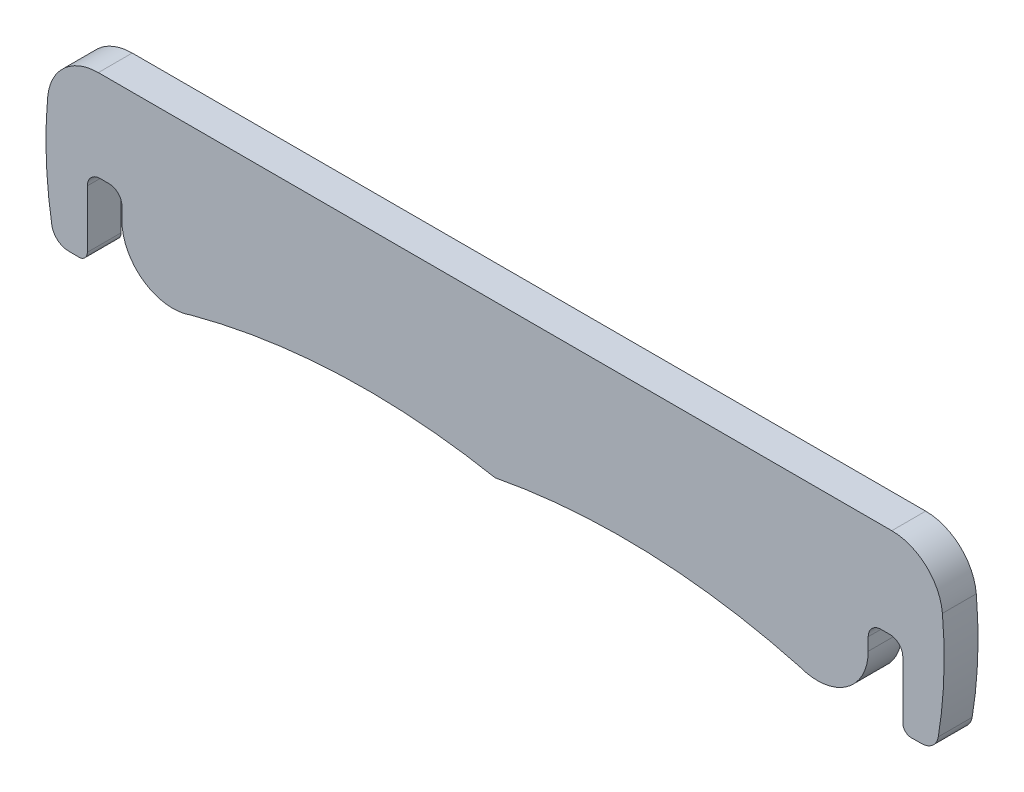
ISO-10303-21;
HEADER;
FILE_DESCRIPTION(('STEP AP214'),'2;1');
FILE_NAME('part.step','',(''),(''),'','','');
FILE_SCHEMA(('AUTOMOTIVE_DESIGN { 1 0 10303 214 1 1 1 1 }'));
ENDSEC;
DATA;
#1=APPLICATION_CONTEXT('core data for automotive mechanical design processes');
#2=APPLICATION_PROTOCOL_DEFINITION('international standard','automotive_design',2000,#1);
#3=PRODUCT_CONTEXT('',#1,'mechanical');
#4=PRODUCT('Part','Part','',(#3));
#5=PRODUCT_RELATED_PRODUCT_CATEGORY('part','',(#4));
#6=PRODUCT_DEFINITION_FORMATION('','',#4);
#7=PRODUCT_DEFINITION_CONTEXT('part definition',#1,'design');
#8=PRODUCT_DEFINITION('design','',#6,#7);
#9=PRODUCT_DEFINITION_SHAPE('','',#8);
#10=(LENGTH_UNIT() NAMED_UNIT(*) SI_UNIT(.MILLI.,.METRE.));
#11=(NAMED_UNIT(*) PLANE_ANGLE_UNIT() SI_UNIT($,.RADIAN.));
#12=(NAMED_UNIT(*) SI_UNIT($,.STERADIAN.) SOLID_ANGLE_UNIT());
#13=UNCERTAINTY_MEASURE_WITH_UNIT(LENGTH_MEASURE(1.E-05),#10,'distance_accuracy_value','');
#14=(GEOMETRIC_REPRESENTATION_CONTEXT(3) GLOBAL_UNCERTAINTY_ASSIGNED_CONTEXT((#13)) GLOBAL_UNIT_ASSIGNED_CONTEXT((#10,
#11,#12)) REPRESENTATION_CONTEXT('',''));
#15=CARTESIAN_POINT('',(0.,0.,0.));
#16=DIRECTION('',(0.,0.,1.));
#17=DIRECTION('',(1.,0.,0.));
#18=AXIS2_PLACEMENT_3D('',#15,#16,#17);
#19=CARTESIAN_POINT('',(-134.420915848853,-25.6748577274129,12.7));
#20=DIRECTION('',(0.,0.,1.));
#21=DIRECTION('',(1.,0.,0.));
#22=AXIS2_PLACEMENT_3D('',#19,#20,#21);
#23=CYLINDRICAL_SURFACE('',#22,6.3499999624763);
#24=DIRECTION('',(0.,0.,1.));
#25=VECTOR('',#24,1.);
#26=CARTESIAN_POINT('',(-140.683934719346,-26.7222803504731,12.7));
#27=LINE('',#26,#25);
#28=CARTESIAN_POINT('',(-140.683934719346,-26.7222803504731,12.7));
#29=VERTEX_POINT('',#28);
#30=CARTESIAN_POINT('',(-140.683934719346,-26.7222803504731,25.4));
#31=VERTEX_POINT('',#30);
#32=EDGE_CURVE('E12',#29,#31,#27,.T.);
#33=ORIENTED_EDGE('',*,*,#32,.F.);
#34=CARTESIAN_POINT('',(-134.420915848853,-25.6748577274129,12.7));
#35=DIRECTION('',(0.,0.,1.));
#36=DIRECTION('',(1.,0.,0.));
#37=AXIS2_PLACEMENT_3D('',#34,#35,#36);
#38=CIRCLE('',#37,6.3499999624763);
#39=CARTESIAN_POINT('',(-134.501831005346,-32.0243421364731,12.7));
#40=VERTEX_POINT('',#39);
#41=EDGE_CURVE('E314',#29,#40,#38,.T.);
#42=ORIENTED_EDGE('',*,*,#41,.T.);
#43=DIRECTION('',(0.,0.,1.));
#44=VECTOR('',#43,1.);
#45=CARTESIAN_POINT('',(-134.501831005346,-32.0243421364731,12.7));
#46=LINE('',#45,#44);
#47=CARTESIAN_POINT('',(-134.501831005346,-32.0243421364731,25.4));
#48=VERTEX_POINT('',#47);
#49=EDGE_CURVE('E31',#40,#48,#46,.T.);
#50=ORIENTED_EDGE('',*,*,#49,.T.);
#51=CARTESIAN_POINT('',(-134.420915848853,-25.6748577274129,25.4));
#52=DIRECTION('',(0.,0.,1.));
#53=DIRECTION('',(1.,0.,0.));
#54=AXIS2_PLACEMENT_3D('',#51,#52,#53);
#55=CIRCLE('',#54,6.3499999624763);
#56=EDGE_CURVE('E323',#31,#48,#55,.T.);
#57=ORIENTED_EDGE('',*,*,#56,.F.);
#58=EDGE_LOOP('',(#33,#42,#50,#57));
#59=FACE_BOUND('',#58,.T.);
#60=ADVANCED_FACE('F20',(#59),#23,.T.);
#61=CARTESIAN_POINT('',(-130.601670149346,-32.0740319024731,12.7));
#62=DIRECTION('',(-0.0127394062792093,-0.999918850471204,0.));
#63=DIRECTION('',(0.999918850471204,-0.0127394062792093,0.));
#64=AXIS2_PLACEMENT_3D('',#61,#62,#63);
#65=PLANE('',#64);
#66=ORIENTED_EDGE('',*,*,#49,.F.);
#67=DIRECTION('',(0.999918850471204,-0.0127394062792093,0.));
#68=VECTOR('',#67,1.);
#69=CARTESIAN_POINT('',(-130.601670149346,-32.0740319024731,12.7));
#70=LINE('',#69,#68);
#71=CARTESIAN_POINT('',(-130.601670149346,-32.0740319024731,12.7));
#72=VERTEX_POINT('',#71);
#73=EDGE_CURVE('E308',#40,#72,#70,.T.);
#74=ORIENTED_EDGE('',*,*,#73,.T.);
#75=DIRECTION('',(0.,0.,1.));
#76=VECTOR('',#75,1.);
#77=CARTESIAN_POINT('',(-130.601670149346,-32.0740319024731,12.7));
#78=LINE('',#77,#76);
#79=CARTESIAN_POINT('',(-130.601670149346,-32.0740319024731,25.4));
#80=VERTEX_POINT('',#79);
#81=EDGE_CURVE('E510',#72,#80,#78,.T.);
#82=ORIENTED_EDGE('',*,*,#81,.T.);
#83=DIRECTION('',(0.999918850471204,-0.0127394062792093,0.));
#84=VECTOR('',#83,1.);
#85=CARTESIAN_POINT('',(-130.601670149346,-32.0740319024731,25.4));
#86=LINE('',#85,#84);
#87=EDGE_CURVE('E331',#48,#80,#86,.T.);
#88=ORIENTED_EDGE('',*,*,#87,.F.);
#89=EDGE_LOOP('',(#66,#74,#82,#88));
#90=FACE_BOUND('',#89,.T.);
#91=ADVANCED_FACE('F525',(#90),#65,.T.);
#92=CARTESIAN_POINT('',(-130.561209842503,-28.8992878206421,12.7));
#93=DIRECTION('',(0.,0.,1.));
#94=DIRECTION('',(1.,0.,0.));
#95=AXIS2_PLACEMENT_3D('',#92,#93,#94);
#96=CYLINDRICAL_SURFACE('',#95,3.17500189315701);
#97=ORIENTED_EDGE('',*,*,#81,.F.);
#98=CARTESIAN_POINT('',(-130.561209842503,-28.8992878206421,12.7));
#99=DIRECTION('',(0.,0.,1.));
#100=DIRECTION('',(1.,0.,0.));
#101=AXIS2_PLACEMENT_3D('',#98,#99,#100);
#102=CIRCLE('',#101,3.17500189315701);
#103=CARTESIAN_POINT('',(-127.386207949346,-28.899285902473,12.7));
#104=VERTEX_POINT('',#103);
#105=EDGE_CURVE('E304',#72,#104,#102,.T.);
#106=ORIENTED_EDGE('',*,*,#105,.T.);
#107=DIRECTION('',(0.,0.,1.));
#108=VECTOR('',#107,1.);
#109=CARTESIAN_POINT('',(-127.386207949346,-28.899285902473,12.7));
#110=LINE('',#109,#108);
#111=CARTESIAN_POINT('',(-127.386207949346,-28.899285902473,25.4));
#112=VERTEX_POINT('',#111);
#113=EDGE_CURVE('E502',#104,#112,#110,.T.);
#114=ORIENTED_EDGE('',*,*,#113,.T.);
#115=CARTESIAN_POINT('',(-130.561209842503,-28.8992878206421,25.4));
#116=DIRECTION('',(0.,0.,1.));
#117=DIRECTION('',(1.,0.,0.));
#118=AXIS2_PLACEMENT_3D('',#115,#116,#117);
#119=CIRCLE('',#118,3.17500189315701);
#120=EDGE_CURVE('E334',#80,#112,#119,.T.);
#121=ORIENTED_EDGE('',*,*,#120,.F.);
#122=EDGE_LOOP('',(#97,#106,#114,#121));
#123=FACE_BOUND('',#122,.T.);
#124=ADVANCED_FACE('F528',(#123),#96,.T.);
#125=CARTESIAN_POINT('',(-127.386207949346,-7.336057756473,12.7));
#126=DIRECTION('',(1.,0.,0.));
#127=DIRECTION('',(0.,1.,0.));
#128=AXIS2_PLACEMENT_3D('',#125,#126,#127);
#129=PLANE('',#128);
#130=ORIENTED_EDGE('',*,*,#113,.F.);
#131=DIRECTION('',(0.,1.,0.));
#132=VECTOR('',#131,1.);
#133=CARTESIAN_POINT('',(-127.386207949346,-7.336057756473,12.7));
#134=LINE('',#133,#132);
#135=CARTESIAN_POINT('',(-127.386207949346,-7.336057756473,12.7));
#136=VERTEX_POINT('',#135);
#137=EDGE_CURVE('E300',#104,#136,#134,.T.);
#138=ORIENTED_EDGE('',*,*,#137,.T.);
#139=DIRECTION('',(0.,0.,1.));
#140=VECTOR('',#139,1.);
#141=CARTESIAN_POINT('',(-127.386207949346,-7.336057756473,12.7));
#142=LINE('',#141,#140);
#143=CARTESIAN_POINT('',(-127.386207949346,-7.336057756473,25.4));
#144=VERTEX_POINT('',#143);
#145=EDGE_CURVE('E499',#136,#144,#142,.T.);
#146=ORIENTED_EDGE('',*,*,#145,.T.);
#147=DIRECTION('',(0.,1.,0.));
#148=VECTOR('',#147,1.);
#149=CARTESIAN_POINT('',(-127.386207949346,12.4251426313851,25.4));
#150=LINE('',#149,#148);
#151=EDGE_CURVE('E338',#112,#144,#150,.T.);
#152=ORIENTED_EDGE('',*,*,#151,.F.);
#153=EDGE_LOOP('',(#130,#138,#146,#152));
#154=FACE_BOUND('',#153,.T.);
#155=ADVANCED_FACE('F533',(#154),#129,.T.);
#156=CARTESIAN_POINT('',(-122.611007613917,-7.33605756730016,12.7));
#157=DIRECTION('',(0.,0.,-1.));
#158=DIRECTION('',(-1.,0.,0.));
#159=AXIS2_PLACEMENT_3D('',#156,#157,#158);
#160=CYLINDRICAL_SURFACE('',#159,4.77520033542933);
#161=ORIENTED_EDGE('',*,*,#145,.F.);
#162=CARTESIAN_POINT('',(-122.611007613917,-7.33605756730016,12.7));
#163=DIRECTION('',(0.,0.,-1.));
#164=DIRECTION('',(1.,0.,0.));
#165=AXIS2_PLACEMENT_3D('',#162,#163,#164);
#166=CIRCLE('',#165,4.77520033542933);
#167=CARTESIAN_POINT('',(-122.611007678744,-2.56085723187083,12.7));
#168=VERTEX_POINT('',#167);
#169=EDGE_CURVE('E297',#136,#168,#166,.T.);
#170=ORIENTED_EDGE('',*,*,#169,.T.);
#171=DIRECTION('',(0.,0.,1.));
#172=VECTOR('',#171,1.);
#173=CARTESIAN_POINT('',(-122.611007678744,-2.56085723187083,12.7));
#174=LINE('',#173,#172);
#175=CARTESIAN_POINT('',(-122.611007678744,-2.56085723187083,25.4));
#176=VERTEX_POINT('',#175);
#177=EDGE_CURVE('E496',#168,#176,#174,.T.);
#178=ORIENTED_EDGE('',*,*,#177,.T.);
#179=CARTESIAN_POINT('',(-122.611007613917,-7.33605756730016,25.4));
#180=DIRECTION('',(0.,0.,-1.));
#181=DIRECTION('',(-1.,0.,0.));
#182=AXIS2_PLACEMENT_3D('',#179,#180,#181);
#183=CIRCLE('',#182,4.77520033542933);
#184=EDGE_CURVE('E342',#144,#176,#183,.T.);
#185=ORIENTED_EDGE('',*,*,#184,.F.);
#186=EDGE_LOOP('',(#161,#170,#178,#185));
#187=FACE_BOUND('',#186,.T.);
#188=ADVANCED_FACE('F539',(#187),#160,.F.);
#189=CARTESIAN_POINT('',(-119.206290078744,-2.56085723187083,12.7));
#190=DIRECTION('',(0.,-1.,0.));
#191=DIRECTION('',(1.,0.,0.));
#192=AXIS2_PLACEMENT_3D('',#189,#190,#191);
#193=PLANE('',#192);
#194=ORIENTED_EDGE('',*,*,#177,.F.);
#195=DIRECTION('',(1.,0.,0.));
#196=VECTOR('',#195,1.);
#197=CARTESIAN_POINT('',(-119.206290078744,-2.56085723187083,12.7));
#198=LINE('',#197,#196);
#199=CARTESIAN_POINT('',(-119.206290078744,-2.56085723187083,12.7));
#200=VERTEX_POINT('',#199);
#201=EDGE_CURVE('E289',#168,#200,#198,.T.);
#202=ORIENTED_EDGE('',*,*,#201,.T.);
#203=DIRECTION('',(0.,0.,1.));
#204=VECTOR('',#203,1.);
#205=CARTESIAN_POINT('',(-119.206290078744,-2.56085723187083,12.7));
#206=LINE('',#205,#204);
#207=CARTESIAN_POINT('',(-119.206290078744,-2.56085723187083,25.4));
#208=VERTEX_POINT('',#207);
#209=EDGE_CURVE('E494',#200,#208,#206,.T.);
#210=ORIENTED_EDGE('',*,*,#209,.T.);
#211=DIRECTION('',(1.,0.,0.));
#212=VECTOR('',#211,1.);
#213=CARTESIAN_POINT('',(-123.258276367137,-2.56085723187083,25.4));
#214=LINE('',#213,#212);
#215=EDGE_CURVE('E350',#176,#208,#214,.T.);
#216=ORIENTED_EDGE('',*,*,#215,.F.);
#217=EDGE_LOOP('',(#194,#202,#210,#216));
#218=FACE_BOUND('',#217,.T.);
#219=ADVANCED_FACE('F542',(#218),#193,.T.);
#220=CARTESIAN_POINT('',(-119.207413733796,-7.33606342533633,12.7));
#221=DIRECTION('',(0.,0.,-1.));
#222=DIRECTION('',(-1.,0.,0.));
#223=AXIS2_PLACEMENT_3D('',#220,#221,#222);
#224=CYLINDRICAL_SURFACE('',#223,4.7752063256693);
#225=ORIENTED_EDGE('',*,*,#209,.F.);
#226=CARTESIAN_POINT('',(-119.207413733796,-7.33606342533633,12.7));
#227=DIRECTION('',(0.,0.,-1.));
#228=DIRECTION('',(1.,0.,0.));
#229=AXIS2_PLACEMENT_3D('',#226,#227,#228);
#230=CIRCLE('',#229,4.7752063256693);
#231=CARTESIAN_POINT('',(-114.432207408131,-7.33605750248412,12.7));
#232=VERTEX_POINT('',#231);
#233=EDGE_CURVE('E285',#200,#232,#230,.T.);
#234=ORIENTED_EDGE('',*,*,#233,.T.);
#235=DIRECTION('',(0.,0.,1.));
#236=VECTOR('',#235,1.);
#237=CARTESIAN_POINT('',(-114.432207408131,-7.33605750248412,12.7));
#238=LINE('',#237,#236);
#239=CARTESIAN_POINT('',(-114.432207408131,-7.33605750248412,25.4));
#240=VERTEX_POINT('',#239);
#241=EDGE_CURVE('E486',#232,#240,#238,.T.);
#242=ORIENTED_EDGE('',*,*,#241,.T.);
#243=CARTESIAN_POINT('',(-119.207413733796,-7.33606342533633,25.4));
#244=DIRECTION('',(0.,0.,-1.));
#245=DIRECTION('',(-1.,0.,0.));
#246=AXIS2_PLACEMENT_3D('',#243,#244,#245);
#247=CIRCLE('',#246,4.7752063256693);
#248=EDGE_CURVE('E353',#208,#240,#247,.T.);
#249=ORIENTED_EDGE('',*,*,#248,.F.);
#250=EDGE_LOOP('',(#225,#234,#242,#249));
#251=FACE_BOUND('',#250,.T.);
#252=ADVANCED_FACE('F547',(#251),#224,.F.);
#253=CARTESIAN_POINT('',(-114.432207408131,-12.0663508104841,12.7));
#254=DIRECTION('',(-1.,0.,0.));
#255=DIRECTION('',(0.,-1.,0.));
#256=AXIS2_PLACEMENT_3D('',#253,#254,#255);
#257=PLANE('',#256);
#258=ORIENTED_EDGE('',*,*,#241,.F.);
#259=DIRECTION('',(0.,-1.,0.));
#260=VECTOR('',#259,1.);
#261=CARTESIAN_POINT('',(-114.432207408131,-12.0663508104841,12.7));
#262=LINE('',#261,#260);
#263=CARTESIAN_POINT('',(-114.432207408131,-12.0663508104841,12.7));
#264=VERTEX_POINT('',#263);
#265=EDGE_CURVE('E281',#232,#264,#262,.T.);
#266=ORIENTED_EDGE('',*,*,#265,.T.);
#267=DIRECTION('',(0.,0.,1.));
#268=VECTOR('',#267,1.);
#269=CARTESIAN_POINT('',(-114.432207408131,-12.0663508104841,12.7));
#270=LINE('',#269,#268);
#271=CARTESIAN_POINT('',(-114.432207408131,-12.0663508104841,25.4));
#272=VERTEX_POINT('',#271);
#273=EDGE_CURVE('E483',#264,#272,#270,.T.);
#274=ORIENTED_EDGE('',*,*,#273,.T.);
#275=DIRECTION('',(0.,1.,0.));
#276=VECTOR('',#275,1.);
#277=CARTESIAN_POINT('',(-114.432207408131,12.4251426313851,25.4));
#278=LINE('',#277,#276);
#279=EDGE_CURVE('E357',#240,#272,#278,.F.);
#280=ORIENTED_EDGE('',*,*,#279,.F.);
#281=EDGE_LOOP('',(#258,#266,#274,#280));
#282=FACE_BOUND('',#281,.T.);
#283=ADVANCED_FACE('F552',(#282),#257,.T.);
#284=CARTESIAN_POINT('',(-95.3822074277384,-12.0663504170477,12.7));
#285=DIRECTION('',(0.,0.,1.));
#286=DIRECTION('',(1.,0.,0.));
#287=AXIS2_PLACEMENT_3D('',#284,#285,#286);
#288=CYLINDRICAL_SURFACE('',#287,19.0499999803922);
#289=ORIENTED_EDGE('',*,*,#273,.F.);
#290=CARTESIAN_POINT('',(-95.3822074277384,-12.0663504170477,12.7));
#291=DIRECTION('',(0.,0.,1.));
#292=DIRECTION('',(1.,0.,0.));
#293=AXIS2_PLACEMENT_3D('',#290,#291,#292);
#294=CIRCLE('',#293,19.0499999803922);
#295=CARTESIAN_POINT('',(-88.6969866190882,-29.9048010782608,12.7));
#296=VERTEX_POINT('',#295);
#297=EDGE_CURVE('E278',#264,#296,#294,.T.);
#298=ORIENTED_EDGE('',*,*,#297,.T.);
#299=DIRECTION('',(0.,0.,1.));
#300=VECTOR('',#299,1.);
#301=CARTESIAN_POINT('',(-88.6969866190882,-29.9048010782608,12.7));
#302=LINE('',#301,#300);
#303=CARTESIAN_POINT('',(-88.6969866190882,-29.9048010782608,25.4));
#304=VERTEX_POINT('',#303);
#305=EDGE_CURVE('E480',#296,#304,#302,.T.);
#306=ORIENTED_EDGE('',*,*,#305,.T.);
#307=CARTESIAN_POINT('',(-95.3822074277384,-12.0663504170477,25.4));
#308=DIRECTION('',(0.,0.,1.));
#309=DIRECTION('',(1.,0.,0.));
#310=AXIS2_PLACEMENT_3D('',#307,#308,#309);
#311=CIRCLE('',#310,19.0499999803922);
#312=EDGE_CURVE('E360',#272,#304,#311,.T.);
#313=ORIENTED_EDGE('',*,*,#312,.F.);
#314=EDGE_LOOP('',(#289,#298,#306,#313));
#315=FACE_BOUND('',#314,.T.);
#316=ADVANCED_FACE('F554',(#315),#288,.T.);
#317=CARTESIAN_POINT('',(-22.4791135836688,-275.121414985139,12.7));
#318=DIRECTION('',(0.,0.,-1.));
#319=DIRECTION('',(-1.,0.,0.));
#320=AXIS2_PLACEMENT_3D('',#317,#318,#319);
#321=CYLINDRICAL_SURFACE('',#320,253.999989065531);
#322=ORIENTED_EDGE('',*,*,#305,.F.);
#323=CARTESIAN_POINT('',(-22.4791135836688,-275.121414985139,12.7));
#324=DIRECTION('',(0.,0.,-1.));
#325=DIRECTION('',(1.,0.,0.));
#326=AXIS2_PLACEMENT_3D('',#323,#324,#325);
#327=CIRCLE('',#326,253.999989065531);
#328=CARTESIAN_POINT('',(25.4,-25.6748577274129,12.7));
#329=VERTEX_POINT('',#328);
#330=EDGE_CURVE('E270',#296,#329,#327,.T.);
#331=ORIENTED_EDGE('',*,*,#330,.T.);
#332=DIRECTION('',(0.,0.,1.));
#333=VECTOR('',#332,1.);
#334=CARTESIAN_POINT('',(25.4,-25.6748577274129,12.7));
#335=LINE('',#334,#333);
#336=CARTESIAN_POINT('',(25.4,-25.6748577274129,25.4));
#337=VERTEX_POINT('',#336);
#338=EDGE_CURVE('E478',#329,#337,#335,.T.);
#339=ORIENTED_EDGE('',*,*,#338,.T.);
#340=CARTESIAN_POINT('',(-22.4791135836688,-275.121414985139,25.4));
#341=DIRECTION('',(0.,0.,-1.));
#342=DIRECTION('',(-1.,0.,0.));
#343=AXIS2_PLACEMENT_3D('',#340,#341,#342);
#344=CIRCLE('',#343,253.999989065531);
#345=EDGE_CURVE('E364',#304,#337,#344,.T.);
#346=ORIENTED_EDGE('',*,*,#345,.F.);
#347=EDGE_LOOP('',(#322,#331,#339,#346));
#348=FACE_BOUND('',#347,.T.);
#349=ADVANCED_FACE('F560',(#348),#321,.F.);
#350=CARTESIAN_POINT('',(73.2791135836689,-275.121414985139,12.7));
#351=DIRECTION('',(0.,0.,-1.));
#352=DIRECTION('',(-1.,0.,0.));
#353=AXIS2_PLACEMENT_3D('',#350,#351,#352);
#354=CYLINDRICAL_SURFACE('',#353,253.999989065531);
#355=ORIENTED_EDGE('',*,*,#338,.F.);
#356=CARTESIAN_POINT('',(73.2791135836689,-275.121414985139,12.7));
#357=DIRECTION('',(0.,0.,-1.));
#358=DIRECTION('',(-1.,0.,0.));
#359=AXIS2_PLACEMENT_3D('',#356,#357,#358);
#360=CIRCLE('',#359,253.999989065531);
#361=CARTESIAN_POINT('',(139.496986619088,-29.9048010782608,12.7));
#362=VERTEX_POINT('',#361);
#363=EDGE_CURVE('E266',#329,#362,#360,.T.);
#364=ORIENTED_EDGE('',*,*,#363,.T.);
#365=DIRECTION('',(0.,0.,1.));
#366=VECTOR('',#365,1.);
#367=CARTESIAN_POINT('',(139.496986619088,-29.9048010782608,12.7));
#368=LINE('',#367,#366);
#369=CARTESIAN_POINT('',(139.496986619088,-29.9048010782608,25.4));
#370=VERTEX_POINT('',#369);
#371=EDGE_CURVE('E470',#362,#370,#368,.T.);
#372=ORIENTED_EDGE('',*,*,#371,.T.);
#373=CARTESIAN_POINT('',(73.2791135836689,-275.121414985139,25.4));
#374=DIRECTION('',(0.,0.,-1.));
#375=DIRECTION('',(-1.,0.,0.));
#376=AXIS2_PLACEMENT_3D('',#373,#374,#375);
#377=CIRCLE('',#376,253.999989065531);
#378=EDGE_CURVE('E372',#337,#370,#377,.T.);
#379=ORIENTED_EDGE('',*,*,#378,.F.);
#380=EDGE_LOOP('',(#355,#364,#372,#379));
#381=FACE_BOUND('',#380,.T.);
#382=ADVANCED_FACE('F566',(#381),#354,.F.);
#383=CARTESIAN_POINT('',(146.182207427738,-12.0663504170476,12.7));
#384=DIRECTION('',(0.,0.,1.));
#385=DIRECTION('',(1.,0.,0.));
#386=AXIS2_PLACEMENT_3D('',#383,#384,#385);
#387=CYLINDRICAL_SURFACE('',#386,19.0499999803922);
#388=ORIENTED_EDGE('',*,*,#371,.F.);
#389=CARTESIAN_POINT('',(146.182207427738,-12.0663504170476,12.7));
#390=DIRECTION('',(0.,0.,1.));
#391=DIRECTION('',(-1.,0.,0.));
#392=AXIS2_PLACEMENT_3D('',#389,#390,#391);
#393=CIRCLE('',#392,19.0499999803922);
#394=CARTESIAN_POINT('',(165.232207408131,-12.0663508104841,12.7));
#395=VERTEX_POINT('',#394);
#396=EDGE_CURVE('E262',#362,#395,#393,.T.);
#397=ORIENTED_EDGE('',*,*,#396,.T.);
#398=DIRECTION('',(0.,0.,1.));
#399=VECTOR('',#398,1.);
#400=CARTESIAN_POINT('',(165.232207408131,-12.0663508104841,12.7));
#401=LINE('',#400,#399);
#402=CARTESIAN_POINT('',(165.232207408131,-12.0663508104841,25.4));
#403=VERTEX_POINT('',#402);
#404=EDGE_CURVE('E467',#395,#403,#401,.T.);
#405=ORIENTED_EDGE('',*,*,#404,.T.);
#406=CARTESIAN_POINT('',(146.182207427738,-12.0663504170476,25.4));
#407=DIRECTION('',(0.,0.,1.));
#408=DIRECTION('',(1.,0.,0.));
#409=AXIS2_PLACEMENT_3D('',#406,#407,#408);
#410=CIRCLE('',#409,19.0499999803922);
#411=EDGE_CURVE('E375',#370,#403,#410,.T.);
#412=ORIENTED_EDGE('',*,*,#411,.F.);
#413=EDGE_LOOP('',(#388,#397,#405,#412));
#414=FACE_BOUND('',#413,.T.);
#415=ADVANCED_FACE('F568',(#414),#387,.T.);
#416=CARTESIAN_POINT('',(165.232207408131,-12.0663508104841,12.7));
#417=DIRECTION('',(1.,0.,0.));
#418=DIRECTION('',(0.,1.,0.));
#419=AXIS2_PLACEMENT_3D('',#416,#417,#418);
#420=PLANE('',#419);
#421=ORIENTED_EDGE('',*,*,#404,.F.);
#422=DIRECTION('',(0.,1.,0.));
#423=VECTOR('',#422,1.);
#424=CARTESIAN_POINT('',(165.232207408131,-12.0663508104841,12.7));
#425=LINE('',#424,#423);
#426=CARTESIAN_POINT('',(165.232207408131,-7.33605750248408,12.7));
#427=VERTEX_POINT('',#426);
#428=EDGE_CURVE('E259',#395,#427,#425,.T.);
#429=ORIENTED_EDGE('',*,*,#428,.T.);
#430=DIRECTION('',(0.,0.,1.));
#431=VECTOR('',#430,1.);
#432=CARTESIAN_POINT('',(165.232207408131,-7.33605750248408,12.7));
#433=LINE('',#432,#431);
#434=CARTESIAN_POINT('',(165.232207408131,-7.33605750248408,25.4));
#435=VERTEX_POINT('',#434);
#436=EDGE_CURVE('E464',#427,#435,#433,.T.);
#437=ORIENTED_EDGE('',*,*,#436,.T.);
#438=DIRECTION('',(0.,1.,0.));
#439=VECTOR('',#438,1.);
#440=CARTESIAN_POINT('',(165.232207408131,12.4251426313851,25.4));
#441=LINE('',#440,#439);
#442=EDGE_CURVE('E379',#403,#435,#441,.T.);
#443=ORIENTED_EDGE('',*,*,#442,.F.);
#444=EDGE_LOOP('',(#421,#429,#437,#443));
#445=FACE_BOUND('',#444,.T.);
#446=ADVANCED_FACE('F574',(#445),#420,.T.);
#447=CARTESIAN_POINT('',(170.007413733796,-7.33606342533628,12.7));
#448=DIRECTION('',(0.,0.,-1.));
#449=DIRECTION('',(-1.,0.,0.));
#450=AXIS2_PLACEMENT_3D('',#447,#448,#449);
#451=CYLINDRICAL_SURFACE('',#450,4.7752063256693);
#452=ORIENTED_EDGE('',*,*,#436,.F.);
#453=CARTESIAN_POINT('',(170.007413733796,-7.33606342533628,12.7));
#454=DIRECTION('',(0.,0.,-1.));
#455=DIRECTION('',(-1.,0.,0.));
#456=AXIS2_PLACEMENT_3D('',#453,#454,#455);
#457=CIRCLE('',#456,4.7752063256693);
#458=CARTESIAN_POINT('',(170.006290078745,-2.56085723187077,12.7));
#459=VERTEX_POINT('',#458);
#460=EDGE_CURVE('E251',#427,#459,#457,.T.);
#461=ORIENTED_EDGE('',*,*,#460,.T.);
#462=DIRECTION('',(0.,0.,1.));
#463=VECTOR('',#462,1.);
#464=CARTESIAN_POINT('',(170.006290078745,-2.56085723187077,12.7));
#465=LINE('',#464,#463);
#466=CARTESIAN_POINT('',(170.006290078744,-2.56085723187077,25.4));
#467=VERTEX_POINT('',#466);
#468=EDGE_CURVE('E462',#459,#467,#465,.T.);
#469=ORIENTED_EDGE('',*,*,#468,.T.);
#470=CARTESIAN_POINT('',(170.007413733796,-7.33606342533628,25.4));
#471=DIRECTION('',(0.,0.,-1.));
#472=DIRECTION('',(-1.,0.,0.));
#473=AXIS2_PLACEMENT_3D('',#470,#471,#472);
#474=CIRCLE('',#473,4.7752063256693);
#475=EDGE_CURVE('E383',#435,#467,#474,.T.);
#476=ORIENTED_EDGE('',*,*,#475,.F.);
#477=EDGE_LOOP('',(#452,#461,#469,#476));
#478=FACE_BOUND('',#477,.T.);
#479=ADVANCED_FACE('F580',(#478),#451,.F.);
#480=CARTESIAN_POINT('',(170.006290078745,-2.56085723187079,12.7));
#481=DIRECTION('',(0.,-1.,0.));
#482=DIRECTION('',(1.,0.,0.));
#483=AXIS2_PLACEMENT_3D('',#480,#481,#482);
#484=PLANE('',#483);
#485=ORIENTED_EDGE('',*,*,#468,.F.);
#486=DIRECTION('',(1.,0.,0.));
#487=VECTOR('',#486,1.);
#488=CARTESIAN_POINT('',(170.006290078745,-2.56085723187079,12.7));
#489=LINE('',#488,#487);
#490=CARTESIAN_POINT('',(173.411007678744,-2.56085723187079,12.7));
#491=VERTEX_POINT('',#490);
#492=EDGE_CURVE('E247',#459,#491,#489,.T.);
#493=ORIENTED_EDGE('',*,*,#492,.T.);
#494=DIRECTION('',(0.,0.,1.));
#495=VECTOR('',#494,1.);
#496=CARTESIAN_POINT('',(173.411007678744,-2.56085723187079,12.7));
#497=LINE('',#496,#495);
#498=CARTESIAN_POINT('',(173.411007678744,-2.56085723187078,25.4));
#499=VERTEX_POINT('',#498);
#500=EDGE_CURVE('E454',#491,#499,#497,.T.);
#501=ORIENTED_EDGE('',*,*,#500,.T.);
#502=DIRECTION('',(1.,0.,0.));
#503=VECTOR('',#502,1.);
#504=CARTESIAN_POINT('',(-123.258276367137,-2.56085723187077,25.4));
#505=LINE('',#504,#503);
#506=EDGE_CURVE('E391',#467,#499,#505,.T.);
#507=ORIENTED_EDGE('',*,*,#506,.F.);
#508=EDGE_LOOP('',(#485,#493,#501,#507));
#509=FACE_BOUND('',#508,.T.);
#510=ADVANCED_FACE('F582',(#509),#484,.T.);
#511=CARTESIAN_POINT('',(173.411007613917,-7.33605756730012,12.7));
#512=DIRECTION('',(0.,0.,-1.));
#513=DIRECTION('',(-1.,0.,0.));
#514=AXIS2_PLACEMENT_3D('',#511,#512,#513);
#515=CYLINDRICAL_SURFACE('',#514,4.77520033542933);
#516=ORIENTED_EDGE('',*,*,#500,.F.);
#517=CARTESIAN_POINT('',(173.411007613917,-7.33605756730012,12.7));
#518=DIRECTION('',(0.,0.,-1.));
#519=DIRECTION('',(-1.,0.,0.));
#520=AXIS2_PLACEMENT_3D('',#517,#518,#519);
#521=CIRCLE('',#520,4.77520033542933);
#522=CARTESIAN_POINT('',(178.186207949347,-7.33605775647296,12.7));
#523=VERTEX_POINT('',#522);
#524=EDGE_CURVE('E243',#491,#523,#521,.T.);
#525=ORIENTED_EDGE('',*,*,#524,.T.);
#526=DIRECTION('',(0.,0.,1.));
#527=VECTOR('',#526,1.);
#528=CARTESIAN_POINT('',(178.186207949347,-7.33605775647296,12.7));
#529=LINE('',#528,#527);
#530=CARTESIAN_POINT('',(178.186207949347,-7.33605775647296,25.4));
#531=VERTEX_POINT('',#530);
#532=EDGE_CURVE('E451',#523,#531,#529,.T.);
#533=ORIENTED_EDGE('',*,*,#532,.T.);
#534=CARTESIAN_POINT('',(173.411007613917,-7.33605756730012,25.4));
#535=DIRECTION('',(0.,0.,-1.));
#536=DIRECTION('',(-1.,0.,0.));
#537=AXIS2_PLACEMENT_3D('',#534,#535,#536);
#538=CIRCLE('',#537,4.77520033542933);
#539=EDGE_CURVE('E394',#499,#531,#538,.T.);
#540=ORIENTED_EDGE('',*,*,#539,.F.);
#541=EDGE_LOOP('',(#516,#525,#533,#540));
#542=FACE_BOUND('',#541,.T.);
#543=ADVANCED_FACE('F587',(#542),#515,.F.);
#544=CARTESIAN_POINT('',(178.186207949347,-7.33605775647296,12.7));
#545=DIRECTION('',(-1.,0.,0.));
#546=DIRECTION('',(0.,-1.,0.));
#547=AXIS2_PLACEMENT_3D('',#544,#545,#546);
#548=PLANE('',#547);
#549=ORIENTED_EDGE('',*,*,#532,.F.);
#550=DIRECTION('',(0.,-1.,0.));
#551=VECTOR('',#550,1.);
#552=CARTESIAN_POINT('',(178.186207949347,-7.33605775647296,12.7));
#553=LINE('',#552,#551);
#554=CARTESIAN_POINT('',(178.186207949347,-28.899285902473,12.7));
#555=VERTEX_POINT('',#554);
#556=EDGE_CURVE('E240',#523,#555,#553,.T.);
#557=ORIENTED_EDGE('',*,*,#556,.T.);
#558=DIRECTION('',(0.,0.,1.));
#559=VECTOR('',#558,1.);
#560=CARTESIAN_POINT('',(178.186207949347,-28.899285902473,12.7));
#561=LINE('',#560,#559);
#562=CARTESIAN_POINT('',(178.186207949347,-28.899285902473,25.4));
#563=VERTEX_POINT('',#562);
#564=EDGE_CURVE('E448',#555,#563,#561,.T.);
#565=ORIENTED_EDGE('',*,*,#564,.T.);
#566=DIRECTION('',(0.,1.,0.));
#567=VECTOR('',#566,1.);
#568=CARTESIAN_POINT('',(178.186207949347,12.4251426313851,25.4));
#569=LINE('',#568,#567);
#570=EDGE_CURVE('E398',#531,#563,#569,.F.);
#571=ORIENTED_EDGE('',*,*,#570,.F.);
#572=EDGE_LOOP('',(#549,#557,#565,#571));
#573=FACE_BOUND('',#572,.T.);
#574=ADVANCED_FACE('F592',(#573),#548,.T.);
#575=CARTESIAN_POINT('',(181.361209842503,-28.8992878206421,12.7));
#576=DIRECTION('',(0.,0.,1.));
#577=DIRECTION('',(1.,0.,0.));
#578=AXIS2_PLACEMENT_3D('',#575,#576,#577);
#579=CYLINDRICAL_SURFACE('',#578,3.17500189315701);
#580=ORIENTED_EDGE('',*,*,#564,.F.);
#581=CARTESIAN_POINT('',(181.361209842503,-28.8992878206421,12.7));
#582=DIRECTION('',(0.,0.,1.));
#583=DIRECTION('',(-1.,0.,0.));
#584=AXIS2_PLACEMENT_3D('',#581,#582,#583);
#585=CIRCLE('',#584,3.17500189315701);
#586=CARTESIAN_POINT('',(181.401670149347,-32.0740319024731,12.7));
#587=VERTEX_POINT('',#586);
#588=EDGE_CURVE('E232',#555,#587,#585,.T.);
#589=ORIENTED_EDGE('',*,*,#588,.T.);
#590=DIRECTION('',(0.,0.,1.));
#591=VECTOR('',#590,1.);
#592=CARTESIAN_POINT('',(181.401670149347,-32.0740319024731,12.7));
#593=LINE('',#592,#591);
#594=CARTESIAN_POINT('',(181.401670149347,-32.0740319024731,25.4));
#595=VERTEX_POINT('',#594);
#596=EDGE_CURVE('E446',#587,#595,#593,.T.);
#597=ORIENTED_EDGE('',*,*,#596,.T.);
#598=CARTESIAN_POINT('',(181.361209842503,-28.8992878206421,25.4));
#599=DIRECTION('',(0.,0.,1.));
#600=DIRECTION('',(1.,0.,0.));
#601=AXIS2_PLACEMENT_3D('',#598,#599,#600);
#602=CIRCLE('',#601,3.17500189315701);
#603=EDGE_CURVE('E401',#563,#595,#602,.T.);
#604=ORIENTED_EDGE('',*,*,#603,.F.);
#605=EDGE_LOOP('',(#580,#589,#597,#604));
#606=FACE_BOUND('',#605,.T.);
#607=ADVANCED_FACE('F595',(#606),#579,.T.);
#608=CARTESIAN_POINT('',(181.401670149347,-32.074031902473,12.7));
#609=DIRECTION('',(0.0127394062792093,-0.999918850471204,0.));
#610=DIRECTION('',(0.999918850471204,0.0127394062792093,0.));
#611=AXIS2_PLACEMENT_3D('',#608,#609,#610);
#612=PLANE('',#611);
#613=ORIENTED_EDGE('',*,*,#596,.F.);
#614=DIRECTION('',(0.999918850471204,0.0127394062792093,0.));
#615=VECTOR('',#614,1.);
#616=CARTESIAN_POINT('',(181.401670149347,-32.074031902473,12.7));
#617=LINE('',#616,#615);
#618=CARTESIAN_POINT('',(185.301831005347,-32.024342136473,12.7));
#619=VERTEX_POINT('',#618);
#620=EDGE_CURVE('E228',#587,#619,#617,.T.);
#621=ORIENTED_EDGE('',*,*,#620,.T.);
#622=DIRECTION('',(0.,0.,1.));
#623=VECTOR('',#622,1.);
#624=CARTESIAN_POINT('',(185.301831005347,-32.024342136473,12.7));
#625=LINE('',#624,#623);
#626=CARTESIAN_POINT('',(185.301831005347,-32.024342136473,25.4));
#627=VERTEX_POINT('',#626);
#628=EDGE_CURVE('E438',#619,#627,#625,.T.);
#629=ORIENTED_EDGE('',*,*,#628,.T.);
#630=DIRECTION('',(0.999918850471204,0.0127394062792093,0.));
#631=VECTOR('',#630,1.);
#632=CARTESIAN_POINT('',(181.401670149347,-32.074031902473,25.4));
#633=LINE('',#632,#631);
#634=EDGE_CURVE('E405',#595,#627,#633,.T.);
#635=ORIENTED_EDGE('',*,*,#634,.F.);
#636=EDGE_LOOP('',(#613,#621,#629,#635));
#637=FACE_BOUND('',#636,.T.);
#638=ADVANCED_FACE('F600',(#637),#612,.T.);
#639=CARTESIAN_POINT('',(185.220915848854,-25.6748577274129,12.7));
#640=DIRECTION('',(0.,0.,1.));
#641=DIRECTION('',(1.,0.,0.));
#642=AXIS2_PLACEMENT_3D('',#639,#640,#641);
#643=CYLINDRICAL_SURFACE('',#642,6.3499999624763);
#644=ORIENTED_EDGE('',*,*,#628,.F.);
#645=CARTESIAN_POINT('',(185.220915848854,-25.6748577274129,12.7));
#646=DIRECTION('',(0.,0.,1.));
#647=DIRECTION('',(-1.,0.,0.));
#648=AXIS2_PLACEMENT_3D('',#645,#646,#647);
#649=CIRCLE('',#648,6.3499999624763);
#650=CARTESIAN_POINT('',(191.483934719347,-26.722280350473,12.7));
#651=VERTEX_POINT('',#650);
#652=EDGE_CURVE('E224',#619,#651,#649,.T.);
#653=ORIENTED_EDGE('',*,*,#652,.T.);
#654=DIRECTION('',(0.,0.,1.));
#655=VECTOR('',#654,1.);
#656=CARTESIAN_POINT('',(191.483934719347,-26.722280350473,12.7));
#657=LINE('',#656,#655);
#658=CARTESIAN_POINT('',(191.483934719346,-26.722280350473,25.4));
#659=VERTEX_POINT('',#658);
#660=EDGE_CURVE('E435',#651,#659,#657,.T.);
#661=ORIENTED_EDGE('',*,*,#660,.T.);
#662=CARTESIAN_POINT('',(185.220915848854,-25.6748577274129,25.4));
#663=DIRECTION('',(0.,0.,1.));
#664=DIRECTION('',(1.,0.,0.));
#665=AXIS2_PLACEMENT_3D('',#662,#663,#664);
#666=CIRCLE('',#665,6.3499999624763);
#667=EDGE_CURVE('E413',#627,#659,#666,.T.);
#668=ORIENTED_EDGE('',*,*,#667,.F.);
#669=EDGE_LOOP('',(#644,#653,#661,#668));
#670=FACE_BOUND('',#669,.T.);
#671=ADVANCED_FACE('F606',(#670),#643,.T.);
#672=CARTESIAN_POINT('',(33.3427114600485,-0.274807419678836,12.7));
#673=DIRECTION('',(0.,0.,1.));
#674=DIRECTION('',(1.,0.,0.));
#675=AXIS2_PLACEMENT_3D('',#672,#673,#674);
#676=CYLINDRICAL_SURFACE('',#675,160.337504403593);
#677=ORIENTED_EDGE('',*,*,#660,.F.);
#678=CARTESIAN_POINT('',(33.3427114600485,-0.274807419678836,12.7));
#679=DIRECTION('',(0.,0.,1.));
#680=DIRECTION('',(-1.,0.,0.));
#681=AXIS2_PLACEMENT_3D('',#678,#679,#680);
#682=CIRCLE('',#681,160.337504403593);
#683=CARTESIAN_POINT('',(193.031160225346,14.137501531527,12.7));
#684=VERTEX_POINT('',#683);
#685=EDGE_CURVE('E207',#651,#684,#682,.T.);
#686=ORIENTED_EDGE('',*,*,#685,.T.);
#687=DIRECTION('',(0.,0.,1.));
#688=VECTOR('',#687,1.);
#689=CARTESIAN_POINT('',(193.031160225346,14.137501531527,12.7));
#690=LINE('',#689,#688);
#691=CARTESIAN_POINT('',(193.031160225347,14.137501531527,25.4));
#692=VERTEX_POINT('',#691);
#693=EDGE_CURVE('E432',#684,#692,#690,.T.);
#694=ORIENTED_EDGE('',*,*,#693,.T.);
#695=CARTESIAN_POINT('',(33.3427114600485,-0.274807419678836,25.4));
#696=DIRECTION('',(0.,0.,1.));
#697=DIRECTION('',(1.,0.,0.));
#698=AXIS2_PLACEMENT_3D('',#695,#696,#697);
#699=CIRCLE('',#698,160.337504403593);
#700=EDGE_CURVE('E416',#659,#692,#699,.T.);
#701=ORIENTED_EDGE('',*,*,#700,.F.);
#702=EDGE_LOOP('',(#677,#686,#694,#701));
#703=FACE_BOUND('',#702,.T.);
#704=ADVANCED_FACE('F608',(#703),#676,.T.);
#705=CARTESIAN_POINT('',(174.058276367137,12.4251426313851,12.7));
#706=DIRECTION('',(0.,0.,1.));
#707=DIRECTION('',(1.,0.,0.));
#708=AXIS2_PLACEMENT_3D('',#705,#706,#707);
#709=CYLINDRICAL_SURFACE('',#708,19.0499998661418);
#710=ORIENTED_EDGE('',*,*,#693,.F.);
#711=CARTESIAN_POINT('',(174.058276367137,12.4251426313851,12.7));
#712=DIRECTION('',(0.,0.,1.));
#713=DIRECTION('',(-1.,0.,0.));
#714=AXIS2_PLACEMENT_3D('',#711,#712,#713);
#715=CIRCLE('',#714,19.0499998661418);
#716=CARTESIAN_POINT('',(174.058276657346,31.475142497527,12.7));
#717=VERTEX_POINT('',#716);
#718=EDGE_CURVE('E203',#684,#717,#715,.T.);
#719=ORIENTED_EDGE('',*,*,#718,.T.);
#720=DIRECTION('',(0.,0.,1.));
#721=VECTOR('',#720,1.);
#722=CARTESIAN_POINT('',(174.058276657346,31.475142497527,12.7));
#723=LINE('',#722,#721);
#724=CARTESIAN_POINT('',(174.058276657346,31.475142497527,25.4));
#725=VERTEX_POINT('',#724);
#726=EDGE_CURVE('E182',#717,#725,#723,.T.);
#727=ORIENTED_EDGE('',*,*,#726,.T.);
#728=CARTESIAN_POINT('',(174.058276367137,12.4251426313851,25.4));
#729=DIRECTION('',(0.,0.,1.));
#730=DIRECTION('',(1.,0.,0.));
#731=AXIS2_PLACEMENT_3D('',#728,#729,#730);
#732=CIRCLE('',#731,19.0499998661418);
#733=EDGE_CURVE('E420',#692,#725,#732,.T.);
#734=ORIENTED_EDGE('',*,*,#733,.F.);
#735=EDGE_LOOP('',(#710,#719,#727,#734));
#736=FACE_BOUND('',#735,.T.);
#737=ADVANCED_FACE('F610',(#736),#709,.T.);
#738=CARTESIAN_POINT('',(-123.258276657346,31.475142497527,12.7));
#739=DIRECTION('',(0.,1.,0.));
#740=DIRECTION('',(-1.,0.,0.));
#741=AXIS2_PLACEMENT_3D('',#738,#739,#740);
#742=PLANE('',#741);
#743=ORIENTED_EDGE('',*,*,#726,.F.);
#744=DIRECTION('',(-1.,0.,0.));
#745=VECTOR('',#744,1.);
#746=CARTESIAN_POINT('',(-123.258276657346,31.475142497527,12.7));
#747=LINE('',#746,#745);
#748=CARTESIAN_POINT('',(-123.258276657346,31.475142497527,12.7));
#749=VERTEX_POINT('',#748);
#750=EDGE_CURVE('E198',#717,#749,#747,.T.);
#751=ORIENTED_EDGE('',*,*,#750,.T.);
#752=DIRECTION('',(0.,0.,1.));
#753=VECTOR('',#752,1.);
#754=CARTESIAN_POINT('',(-123.258276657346,31.475142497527,12.7));
#755=LINE('',#754,#753);
#756=CARTESIAN_POINT('',(-123.258276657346,31.475142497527,25.4));
#757=VERTEX_POINT('',#756);
#758=EDGE_CURVE('E39',#749,#757,#755,.T.);
#759=ORIENTED_EDGE('',*,*,#758,.T.);
#760=DIRECTION('',(1.,0.,0.));
#761=VECTOR('',#760,1.);
#762=CARTESIAN_POINT('',(-123.258276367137,31.475142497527,25.4));
#763=LINE('',#762,#761);
#764=EDGE_CURVE('E424',#725,#757,#763,.F.);
#765=ORIENTED_EDGE('',*,*,#764,.F.);
#766=EDGE_LOOP('',(#743,#751,#759,#765));
#767=FACE_BOUND('',#766,.T.);
#768=ADVANCED_FACE('F202',(#767),#742,.T.);
#769=CARTESIAN_POINT('',(-123.258276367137,12.4251426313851,12.7));
#770=DIRECTION('',(0.,0.,1.));
#771=DIRECTION('',(1.,0.,0.));
#772=AXIS2_PLACEMENT_3D('',#769,#770,#771);
#773=CYLINDRICAL_SURFACE('',#772,19.0499998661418);
#774=ORIENTED_EDGE('',*,*,#758,.F.);
#775=CARTESIAN_POINT('',(-123.258276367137,12.4251426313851,12.7));
#776=DIRECTION('',(0.,0.,1.));
#777=DIRECTION('',(1.,0.,0.));
#778=AXIS2_PLACEMENT_3D('',#775,#776,#777);
#779=CIRCLE('',#778,19.0499998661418);
#780=CARTESIAN_POINT('',(-142.231160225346,14.1375015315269,12.7));
#781=VERTEX_POINT('',#780);
#782=EDGE_CURVE('E188',#749,#781,#779,.T.);
#783=ORIENTED_EDGE('',*,*,#782,.T.);
#784=DIRECTION('',(0.,0.,1.));
#785=VECTOR('',#784,1.);
#786=CARTESIAN_POINT('',(-142.231160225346,14.1375015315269,12.7));
#787=LINE('',#786,#785);
#788=CARTESIAN_POINT('',(-142.231160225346,14.1375015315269,25.4));
#789=VERTEX_POINT('',#788);
#790=EDGE_CURVE('E24',#781,#789,#787,.T.);
#791=ORIENTED_EDGE('',*,*,#790,.T.);
#792=CARTESIAN_POINT('',(-123.258276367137,12.4251426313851,25.4));
#793=DIRECTION('',(0.,0.,1.));
#794=DIRECTION('',(1.,0.,0.));
#795=AXIS2_PLACEMENT_3D('',#792,#793,#794);
#796=CIRCLE('',#795,19.0499998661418);
#797=EDGE_CURVE('E190',#757,#789,#796,.T.);
#798=ORIENTED_EDGE('',*,*,#797,.F.);
#799=EDGE_LOOP('',(#774,#783,#791,#798));
#800=FACE_BOUND('',#799,.T.);
#801=ADVANCED_FACE('F187',(#800),#773,.T.);
#802=CARTESIAN_POINT('',(17.4572885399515,-0.274807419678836,12.7));
#803=DIRECTION('',(0.,0.,1.));
#804=DIRECTION('',(1.,0.,0.));
#805=AXIS2_PLACEMENT_3D('',#802,#803,#804);
#806=CYLINDRICAL_SURFACE('',#805,160.337504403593);
#807=CARTESIAN_POINT('',(17.4572885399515,-0.274807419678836,12.7));
#808=DIRECTION('',(0.,0.,1.));
#809=DIRECTION('',(1.,0.,0.));
#810=AXIS2_PLACEMENT_3D('',#807,#808,#809);
#811=CIRCLE('',#810,160.337504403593);
#812=EDGE_CURVE('E201',#781,#29,#811,.T.);
#813=ORIENTED_EDGE('',*,*,#812,.T.);
#814=ORIENTED_EDGE('',*,*,#32,.T.);
#815=CARTESIAN_POINT('',(17.4572885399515,-0.274807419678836,25.4));
#816=DIRECTION('',(0.,0.,1.));
#817=DIRECTION('',(1.,0.,0.));
#818=AXIS2_PLACEMENT_3D('',#815,#816,#817);
#819=CIRCLE('',#818,160.337504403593);
#820=EDGE_CURVE('E205',#789,#31,#819,.T.);
#821=ORIENTED_EDGE('',*,*,#820,.F.);
#822=ORIENTED_EDGE('',*,*,#790,.F.);
#823=EDGE_LOOP('',(#813,#814,#821,#822));
#824=FACE_BOUND('',#823,.T.);
#825=ADVANCED_FACE('F22',(#824),#806,.T.);
#826=CARTESIAN_POINT('',(-123.258276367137,12.4251426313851,25.4));
#827=DIRECTION('',(0.,0.,1.));
#828=DIRECTION('',(1.,0.,0.));
#829=AXIS2_PLACEMENT_3D('',#826,#827,#828);
#830=PLANE('',#829);
#831=ORIENTED_EDGE('',*,*,#797,.T.);
#832=ORIENTED_EDGE('',*,*,#820,.T.);
#833=ORIENTED_EDGE('',*,*,#56,.T.);
#834=ORIENTED_EDGE('',*,*,#87,.T.);
#835=ORIENTED_EDGE('',*,*,#120,.T.);
#836=ORIENTED_EDGE('',*,*,#151,.T.);
#837=ORIENTED_EDGE('',*,*,#184,.T.);
#838=ORIENTED_EDGE('',*,*,#215,.T.);
#839=ORIENTED_EDGE('',*,*,#248,.T.);
#840=ORIENTED_EDGE('',*,*,#279,.T.);
#841=ORIENTED_EDGE('',*,*,#312,.T.);
#842=ORIENTED_EDGE('',*,*,#345,.T.);
#843=ORIENTED_EDGE('',*,*,#378,.T.);
#844=ORIENTED_EDGE('',*,*,#411,.T.);
#845=ORIENTED_EDGE('',*,*,#442,.T.);
#846=ORIENTED_EDGE('',*,*,#475,.T.);
#847=ORIENTED_EDGE('',*,*,#506,.T.);
#848=ORIENTED_EDGE('',*,*,#539,.T.);
#849=ORIENTED_EDGE('',*,*,#570,.T.);
#850=ORIENTED_EDGE('',*,*,#603,.T.);
#851=ORIENTED_EDGE('',*,*,#634,.T.);
#852=ORIENTED_EDGE('',*,*,#667,.T.);
#853=ORIENTED_EDGE('',*,*,#700,.T.);
#854=ORIENTED_EDGE('',*,*,#733,.T.);
#855=ORIENTED_EDGE('',*,*,#764,.T.);
#856=EDGE_LOOP('',(#831,#832,#833,#834,#835,#836,#837,#838,#839,#840,#841,#842,#843,#844,#845,
#846,#847,#848,#849,#850,#851,#852,#853,#854,#855));
#857=FACE_BOUND('',#856,.T.);
#858=ADVANCED_FACE('F522',(#857),#830,.T.);
#859=CARTESIAN_POINT('',(-123.258276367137,12.4251426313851,12.7));
#860=DIRECTION('',(0.,0.,1.));
#861=DIRECTION('',(1.,0.,0.));
#862=AXIS2_PLACEMENT_3D('',#859,#860,#861);
#863=PLANE('',#862);
#864=ORIENTED_EDGE('',*,*,#782,.F.);
#865=ORIENTED_EDGE('',*,*,#750,.F.);
#866=ORIENTED_EDGE('',*,*,#718,.F.);
#867=ORIENTED_EDGE('',*,*,#685,.F.);
#868=ORIENTED_EDGE('',*,*,#652,.F.);
#869=ORIENTED_EDGE('',*,*,#620,.F.);
#870=ORIENTED_EDGE('',*,*,#588,.F.);
#871=ORIENTED_EDGE('',*,*,#556,.F.);
#872=ORIENTED_EDGE('',*,*,#524,.F.);
#873=ORIENTED_EDGE('',*,*,#492,.F.);
#874=ORIENTED_EDGE('',*,*,#460,.F.);
#875=ORIENTED_EDGE('',*,*,#428,.F.);
#876=ORIENTED_EDGE('',*,*,#396,.F.);
#877=ORIENTED_EDGE('',*,*,#363,.F.);
#878=ORIENTED_EDGE('',*,*,#330,.F.);
#879=ORIENTED_EDGE('',*,*,#297,.F.);
#880=ORIENTED_EDGE('',*,*,#265,.F.);
#881=ORIENTED_EDGE('',*,*,#233,.F.);
#882=ORIENTED_EDGE('',*,*,#201,.F.);
#883=ORIENTED_EDGE('',*,*,#169,.F.);
#884=ORIENTED_EDGE('',*,*,#137,.F.);
#885=ORIENTED_EDGE('',*,*,#105,.F.);
#886=ORIENTED_EDGE('',*,*,#73,.F.);
#887=ORIENTED_EDGE('',*,*,#41,.F.);
#888=ORIENTED_EDGE('',*,*,#812,.F.);
#889=EDGE_LOOP('',(#864,#865,#866,#867,#868,#869,#870,#871,#872,#873,#874,#875,#876,#877,#878,
#879,#880,#881,#882,#883,#884,#885,#886,#887,#888));
#890=FACE_BOUND('',#889,.T.);
#891=ADVANCED_FACE('F196',(#890),#863,.F.);
#892=CLOSED_SHELL('',(#60,#91,#124,#155,#188,#219,#252,#283,#316,#349,#382,#415,#446,#479,#510,
#543,#574,#607,#638,#671,#704,#737,#768,#801,#825,#858,#891));
#893=MANIFOLD_SOLID_BREP('B1',#892);
#894=ADVANCED_BREP_SHAPE_REPRESENTATION('',(#18,#893),#14);
#895=SHAPE_DEFINITION_REPRESENTATION(#9,#894);
ENDSEC;
END-ISO-10303-21;
